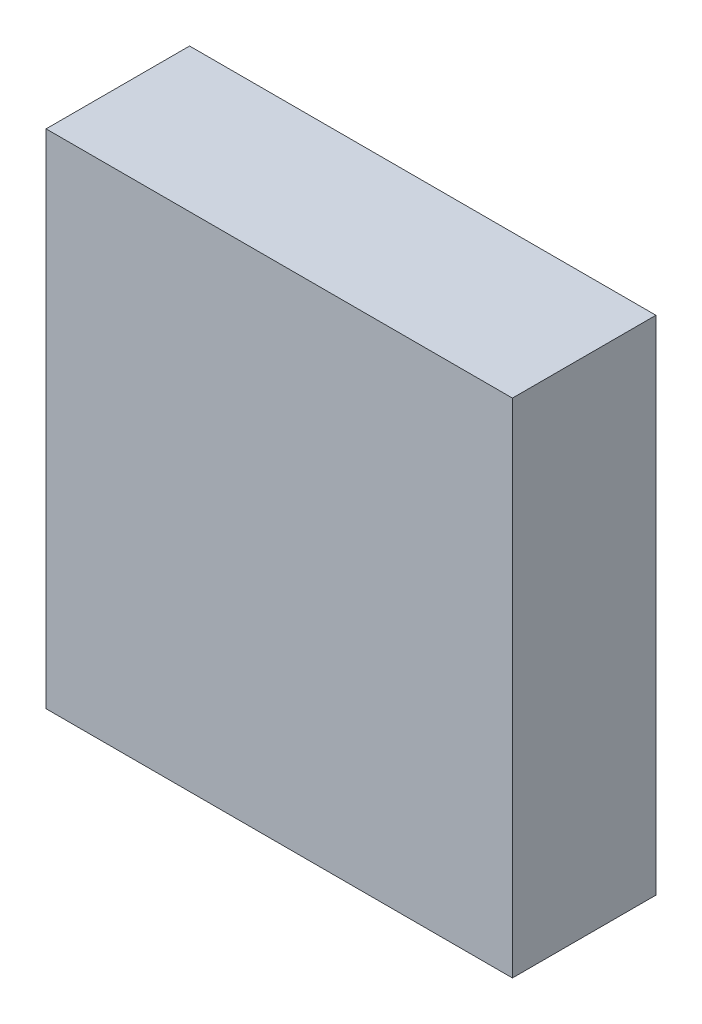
from build123d import *

# Parameters (mm, degrees)
SKIZZE1_W               = 65
SKIZZE1_H               = 70
LINEAR_AUSTRAGEN1_DEPTH = 20


with BuildPart() as part:
    # Skizze1 → Linear austragen1 (new body)
    with BuildSketch(Plane.XY):
        with Locations((32.5, 35)):
            Rectangle(SKIZZE1_W, SKIZZE1_H)
    extrude(amount=LINEAR_AUSTRAGEN1_DEPTH)


solid = part.part
